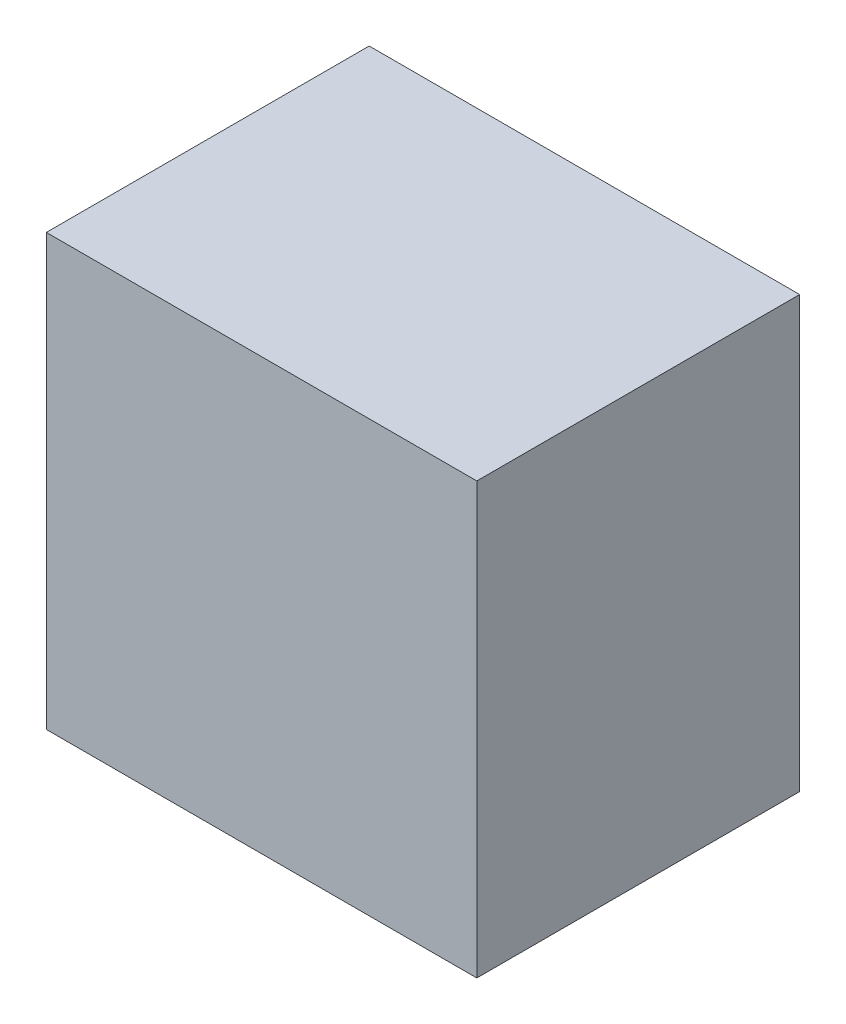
ISO-10303-21;
HEADER;
FILE_DESCRIPTION(('STEP AP214'),'2;1');
FILE_NAME('part.step','',(''),(''),'','','');
FILE_SCHEMA(('AUTOMOTIVE_DESIGN { 1 0 10303 214 1 1 1 1 }'));
ENDSEC;
DATA;
#1=APPLICATION_CONTEXT('core data for automotive mechanical design processes');
#2=APPLICATION_PROTOCOL_DEFINITION('international standard','automotive_design',2000,#1);
#3=PRODUCT_CONTEXT('',#1,'mechanical');
#4=PRODUCT('Part','Part','',(#3));
#5=PRODUCT_RELATED_PRODUCT_CATEGORY('part','',(#4));
#6=PRODUCT_DEFINITION_FORMATION('','',#4);
#7=PRODUCT_DEFINITION_CONTEXT('part definition',#1,'design');
#8=PRODUCT_DEFINITION('design','',#6,#7);
#9=PRODUCT_DEFINITION_SHAPE('','',#8);
#10=(LENGTH_UNIT() NAMED_UNIT(*) SI_UNIT(.MILLI.,.METRE.));
#11=(NAMED_UNIT(*) PLANE_ANGLE_UNIT() SI_UNIT($,.RADIAN.));
#12=(NAMED_UNIT(*) SI_UNIT($,.STERADIAN.) SOLID_ANGLE_UNIT());
#13=UNCERTAINTY_MEASURE_WITH_UNIT(LENGTH_MEASURE(1.E-05),#10,'distance_accuracy_value','');
#14=(GEOMETRIC_REPRESENTATION_CONTEXT(3) GLOBAL_UNCERTAINTY_ASSIGNED_CONTEXT((#13)) GLOBAL_UNIT_ASSIGNED_CONTEXT((#10,
#11,#12)) REPRESENTATION_CONTEXT('',''));
#15=CARTESIAN_POINT('',(0.,0.,0.));
#16=DIRECTION('',(0.,0.,1.));
#17=DIRECTION('',(1.,0.,0.));
#18=AXIS2_PLACEMENT_3D('',#15,#16,#17);
#19=CARTESIAN_POINT('',(-50.,100.,37.5));
#20=DIRECTION('',(1.,0.,0.));
#21=DIRECTION('',(0.,1.,0.));
#22=AXIS2_PLACEMENT_3D('',#19,#20,#21);
#23=PLANE('',#22);
#24=DIRECTION('',(0.,-1.,0.));
#25=VECTOR('',#24,1.);
#26=CARTESIAN_POINT('',(-50.,100.,-37.5));
#27=LINE('',#26,#25);
#28=CARTESIAN_POINT('',(-50.,100.,-37.5));
#29=VERTEX_POINT('',#28);
#30=CARTESIAN_POINT('',(-50.,0.,-37.5));
#31=VERTEX_POINT('',#30);
#32=EDGE_CURVE('E81',#29,#31,#27,.T.);
#33=ORIENTED_EDGE('',*,*,#32,.T.);
#34=DIRECTION('',(0.,0.,-1.));
#35=VECTOR('',#34,1.);
#36=CARTESIAN_POINT('',(-50.,0.,37.5));
#37=LINE('',#36,#35);
#38=CARTESIAN_POINT('',(-50.,0.,37.5));
#39=VERTEX_POINT('',#38);
#40=EDGE_CURVE('E38',#39,#31,#37,.T.);
#41=ORIENTED_EDGE('',*,*,#40,.F.);
#42=DIRECTION('',(0.,-1.,0.));
#43=VECTOR('',#42,1.);
#44=CARTESIAN_POINT('',(-50.,100.,37.5));
#45=LINE('',#44,#43);
#46=CARTESIAN_POINT('',(-50.,100.,37.5));
#47=VERTEX_POINT('',#46);
#48=EDGE_CURVE('E88',#47,#39,#45,.T.);
#49=ORIENTED_EDGE('',*,*,#48,.F.);
#50=DIRECTION('',(0.,0.,-1.));
#51=VECTOR('',#50,1.);
#52=CARTESIAN_POINT('',(-50.,100.,37.5));
#53=LINE('',#52,#51);
#54=EDGE_CURVE('E11',#47,#29,#53,.T.);
#55=ORIENTED_EDGE('',*,*,#54,.T.);
#56=EDGE_LOOP('',(#33,#41,#49,#55));
#57=FACE_BOUND('',#56,.T.);
#58=ADVANCED_FACE('F31',(#57),#23,.F.);
#59=CARTESIAN_POINT('',(-50.,0.,37.5));
#60=DIRECTION('',(0.,1.,0.));
#61=DIRECTION('',(0.,0.,1.));
#62=AXIS2_PLACEMENT_3D('',#59,#60,#61);
#63=PLANE('',#62);
#64=DIRECTION('',(1.,0.,0.));
#65=VECTOR('',#64,1.);
#66=CARTESIAN_POINT('',(-50.,0.,-37.5));
#67=LINE('',#66,#65);
#68=CARTESIAN_POINT('',(50.,0.,-37.5));
#69=VERTEX_POINT('',#68);
#70=EDGE_CURVE('E83',#31,#69,#67,.T.);
#71=ORIENTED_EDGE('',*,*,#70,.T.);
#72=DIRECTION('',(0.,0.,-1.));
#73=VECTOR('',#72,1.);
#74=CARTESIAN_POINT('',(50.,0.,37.5));
#75=LINE('',#74,#73);
#76=CARTESIAN_POINT('',(50.,0.,37.5));
#77=VERTEX_POINT('',#76);
#78=EDGE_CURVE('E99',#77,#69,#75,.T.);
#79=ORIENTED_EDGE('',*,*,#78,.F.);
#80=DIRECTION('',(1.,0.,0.));
#81=VECTOR('',#80,1.);
#82=CARTESIAN_POINT('',(-50.,0.,37.5));
#83=LINE('',#82,#81);
#84=EDGE_CURVE('E52',#39,#77,#83,.T.);
#85=ORIENTED_EDGE('',*,*,#84,.F.);
#86=ORIENTED_EDGE('',*,*,#40,.T.);
#87=EDGE_LOOP('',(#71,#79,#85,#86));
#88=FACE_BOUND('',#87,.T.);
#89=ADVANCED_FACE('F102',(#88),#63,.F.);
#90=CARTESIAN_POINT('',(50.,0.,37.5));
#91=DIRECTION('',(-1.,0.,0.));
#92=DIRECTION('',(0.,-1.,0.));
#93=AXIS2_PLACEMENT_3D('',#90,#91,#92);
#94=PLANE('',#93);
#95=DIRECTION('',(0.,1.,0.));
#96=VECTOR('',#95,1.);
#97=CARTESIAN_POINT('',(50.,0.,-37.5));
#98=LINE('',#97,#96);
#99=CARTESIAN_POINT('',(50.,100.,-37.5));
#100=VERTEX_POINT('',#99);
#101=EDGE_CURVE('E78',#69,#100,#98,.T.);
#102=ORIENTED_EDGE('',*,*,#101,.T.);
#103=DIRECTION('',(0.,0.,-1.));
#104=VECTOR('',#103,1.);
#105=CARTESIAN_POINT('',(50.,100.,37.5));
#106=LINE('',#105,#104);
#107=CARTESIAN_POINT('',(50.,100.,37.5));
#108=VERTEX_POINT('',#107);
#109=EDGE_CURVE('E75',#108,#100,#106,.T.);
#110=ORIENTED_EDGE('',*,*,#109,.F.);
#111=DIRECTION('',(0.,1.,0.));
#112=VECTOR('',#111,1.);
#113=CARTESIAN_POINT('',(50.,0.,37.5));
#114=LINE('',#113,#112);
#115=EDGE_CURVE('E92',#77,#108,#114,.T.);
#116=ORIENTED_EDGE('',*,*,#115,.F.);
#117=ORIENTED_EDGE('',*,*,#78,.T.);
#118=EDGE_LOOP('',(#102,#110,#116,#117));
#119=FACE_BOUND('',#118,.T.);
#120=ADVANCED_FACE('F104',(#119),#94,.F.);
#121=CARTESIAN_POINT('',(0.,100.,37.5));
#122=DIRECTION('',(0.,-1.,0.));
#123=DIRECTION('',(0.,0.,-1.));
#124=AXIS2_PLACEMENT_3D('',#121,#122,#123);
#125=PLANE('',#124);
#126=DIRECTION('',(-1.,0.,0.));
#127=VECTOR('',#126,1.);
#128=CARTESIAN_POINT('',(0.,100.,-37.5));
#129=LINE('',#128,#127);
#130=EDGE_CURVE('E71',#100,#29,#129,.T.);
#131=ORIENTED_EDGE('',*,*,#130,.T.);
#132=ORIENTED_EDGE('',*,*,#54,.F.);
#133=DIRECTION('',(-1.,0.,0.));
#134=VECTOR('',#133,1.);
#135=CARTESIAN_POINT('',(-50.,100.,37.5));
#136=LINE('',#135,#134);
#137=EDGE_CURVE('E45',#108,#47,#136,.T.);
#138=ORIENTED_EDGE('',*,*,#137,.F.);
#139=ORIENTED_EDGE('',*,*,#109,.T.);
#140=EDGE_LOOP('',(#131,#132,#138,#139));
#141=FACE_BOUND('',#140,.T.);
#142=ADVANCED_FACE('F73',(#141),#125,.F.);
#143=CARTESIAN_POINT('',(50.,100.,37.5));
#144=DIRECTION('',(0.,0.,1.));
#145=DIRECTION('',(1.,0.,0.));
#146=AXIS2_PLACEMENT_3D('',#143,#144,#145);
#147=PLANE('',#146);
#148=ORIENTED_EDGE('',*,*,#137,.T.);
#149=ORIENTED_EDGE('',*,*,#48,.T.);
#150=ORIENTED_EDGE('',*,*,#84,.T.);
#151=ORIENTED_EDGE('',*,*,#115,.T.);
#152=EDGE_LOOP('',(#148,#149,#150,#151));
#153=FACE_BOUND('',#152,.T.);
#154=ADVANCED_FACE('F90',(#153),#147,.T.);
#155=CARTESIAN_POINT('',(50.,100.,-37.5));
#156=DIRECTION('',(0.,0.,1.));
#157=DIRECTION('',(1.,0.,0.));
#158=AXIS2_PLACEMENT_3D('',#155,#156,#157);
#159=PLANE('',#158);
#160=ORIENTED_EDGE('',*,*,#32,.F.);
#161=ORIENTED_EDGE('',*,*,#130,.F.);
#162=ORIENTED_EDGE('',*,*,#101,.F.);
#163=ORIENTED_EDGE('',*,*,#70,.F.);
#164=EDGE_LOOP('',(#160,#161,#162,#163));
#165=FACE_BOUND('',#164,.T.);
#166=ADVANCED_FACE('F82',(#165),#159,.F.);
#167=CLOSED_SHELL('',(#58,#89,#120,#142,#154,#166));
#168=MANIFOLD_SOLID_BREP('B2',#167);
#169=ADVANCED_BREP_SHAPE_REPRESENTATION('',(#18,#168),#14);
#170=SHAPE_DEFINITION_REPRESENTATION(#9,#169);
ENDSEC;
END-ISO-10303-21;
